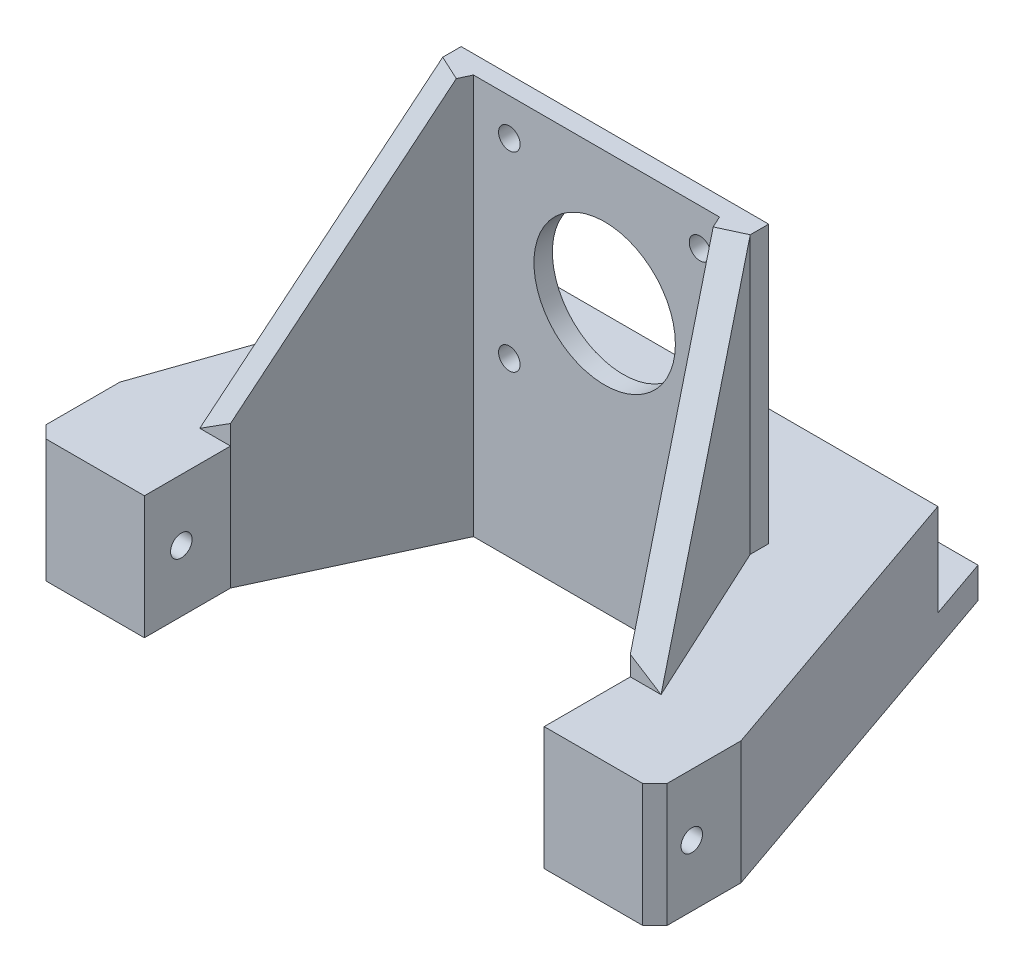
from build123d import *

# Parameters (mm, degrees)
SKETCH_1_R           = 8.05
EXTRUDE_1_DEPTH      = 20
SKETCH_3_W           = 50
SKETCH_3_H           = 3
EXTRUDE_3_DEPTH      = 45
EXTRUDE_START        = -1
SKETCH_7_R           = 8.05
EXTRUDE_6_DEPTH      = 1
SKETCH_9_R           = 1.75
SKETCH_9_R_2         = 11.5
CUT_EXTRUDE_1_DEPTH  = 10
EXTRUDE_8_DEPTH      = 45
CUT_EXTRUDE_4_DEPTH  = 45
CUT_EXTRUDE_5_DEPTH  = 45
SKETCH_18_W          = 18
SKETCH_18_H          = 20
EXTRUDE_9_DEPTH      = 14
SKETCH_19_R          = 1.75
CUT_EXTRUDE_8_DEPTH  = 134
EXTRUDE_10_DEPTH     = 5
SKETCH_21_R          = 1.4
CUT_EXTRUDE_9_DEPTH  = 5
CUT_EXTRUDE_START    = -20
CUT_EXTRUDE_10_DEPTH = 20


with BuildPart() as part:
    # Sketch 1 → Extrude 1 (new body)
    with BuildSketch(Plane(origin=(0, 0, 0), x_dir=(1, 0, 0), z_dir=(0, 1, 0))):
        Polygon((-33.5, 22), (33.5, 22), (50.5, -27), (32.5, -27), (20, 0), (0, 0), (-20, 0), (-32.5, -27), (-50.5, -27), align=None)
        with Locations(Location((25, 10, 0), (0, 0, 270))):
            Circle(SKETCH_1_R, mode=Mode.SUBTRACT)
        with Locations(Location((-25, 10, 0), (0, 0, 270))):
            Circle(SKETCH_1_R, mode=Mode.SUBTRACT)
    extrude(amount=EXTRUDE_1_DEPTH)

    # Sketch 3 → Extrude 3 (add)
    with BuildSketch(Plane(origin=(0, 20, 0), x_dir=(1, 0, 0), z_dir=(0, 1, 0))):
        with Locations((0, 1.5)):
            Rectangle(SKETCH_3_W, SKETCH_3_H)
    extrude(amount=EXTRUDE_3_DEPTH)

    # Sketch 7 → Extrude 6 (add)
    with BuildSketch(Plane(origin=(0, 20, 0), x_dir=(1, 0, 0), z_dir=(0, 1, 0)).offset(EXTRUDE_START)):
        with Locations(Location((-25, 10, 0), (0, 0, 270))):
            Circle(SKETCH_7_R)
        with Locations(Location((25, 10, 0), (0, 0, 270))):
            Circle(SKETCH_7_R)
    extrude(amount=EXTRUDE_6_DEPTH)

    # Sketch 9 → Cut-Extrude 1 (cut)
    with BuildSketch(Plane.XY):
        with Locations((-14.169106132, 59)):
            Circle(SKETCH_9_R)
        with Locations((16.830893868, 59)):
            Circle(SKETCH_9_R)
        with Locations((16.830893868, 28)):
            Circle(SKETCH_9_R)
        with Locations((-14.169106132, 28)):
            Circle(SKETCH_9_R)
        with Locations((1.330893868, 43.5)):
            Circle(SKETCH_9_R_2)
    extrude(amount=-CUT_EXTRUDE_1_DEPTH, mode=Mode.SUBTRACT)

    # Sketch 13 → Extrude 8 (add)
    with BuildSketch(Plane(origin=(0, 20, 0), x_dir=(1, 0, 0), z_dir=(0, 1, 0))):
        Polygon((25, 0), (37.5, -27), (32.5, -27), (20, 0), align=None)
        Polygon((-20, 0), (-25, 0), (-37.5, -27), (-32.5, -27), align=None)
    extrude(amount=EXTRUDE_8_DEPTH)

    # Sketch 14 → Cut-Extrude 4 (cut)
    with BuildSketch(Plane(origin=(20.587404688, 0, -9.531205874), x_dir=(-0.4201235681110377, 0, -0.9074669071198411), z_dir=(0.9074669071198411, 0, -0.4201235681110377))):
        Polygon((-10.503089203, 65), (-40.256240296, 20), (-40.256240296, 65), align=None)
    extrude(amount=-CUT_EXTRUDE_4_DEPTH, mode=Mode.SUBTRACT)

    # Sketch 15 → Cut-Extrude 5 (cut)
    with BuildSketch(Plane(origin=(-20.587404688, 0, -9.531205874), x_dir=(-0.4201235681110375, 0, 0.9074669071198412), z_dir=(-0.9074669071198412, 0, -0.4201235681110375))):
        Polygon((10.503089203, 65), (40.256240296, 20), (40.256240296, 65), align=None)
    extrude(amount=-CUT_EXTRUDE_5_DEPTH, mode=Mode.SUBTRACT)

    # Sketch 18 → Extrude 9 (add)
    with BuildSketch(Plane.XY.offset(27)):
        with Locations((-41.5, 10)):
            Rectangle(SKETCH_18_W, SKETCH_18_H)
        with Locations((41.5, 10)):
            Rectangle(SKETCH_18_W, SKETCH_18_H)
    extrude(amount=EXTRUDE_9_DEPTH)

    # Sketch 19 → Cut-Extrude 8 (cut)
    with BuildSketch(Plane.ZY.offset(50.5)):
        with Locations((35, 10)):
            Circle(SKETCH_19_R)
    extrude(amount=-CUT_EXTRUDE_8_DEPTH, mode=Mode.SUBTRACT)

    # Sketch 20 → Extrude 10 (add)
    with BuildSketch(Plane.XZ):
        Polygon((-33.5, -22), (-30.030612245, -32), (30.030612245, -32), (33.5, -22), align=None)
    extrude(amount=-EXTRUDE_10_DEPTH)

    # Sketch 21 → Cut-Extrude 9 (cut)
    with BuildSketch(Plane.XZ):
        with Locations(Location((-16.6, -26.5, 0), (0, 0, 270))):
            Circle(SKETCH_21_R)
        with Locations(Location((10.9, -26.5, 0), (0, 0, 270))):
            Circle(SKETCH_21_R)
    extrude(amount=-CUT_EXTRUDE_9_DEPTH, mode=Mode.SUBTRACT)

    # Sketch 22 → Cut-Extrude 10 (cut)
    with BuildSketch(Plane.XZ.offset(CUT_EXTRUDE_START)):
        Polygon((-50.5, 39), (-48.5, 41), (-50.5, 41), align=None)
        Polygon((50.5, 41), (50.5, 39), (48.5, 41), align=None)
    extrude(amount=CUT_EXTRUDE_10_DEPTH, mode=Mode.SUBTRACT)


solid = part.part
